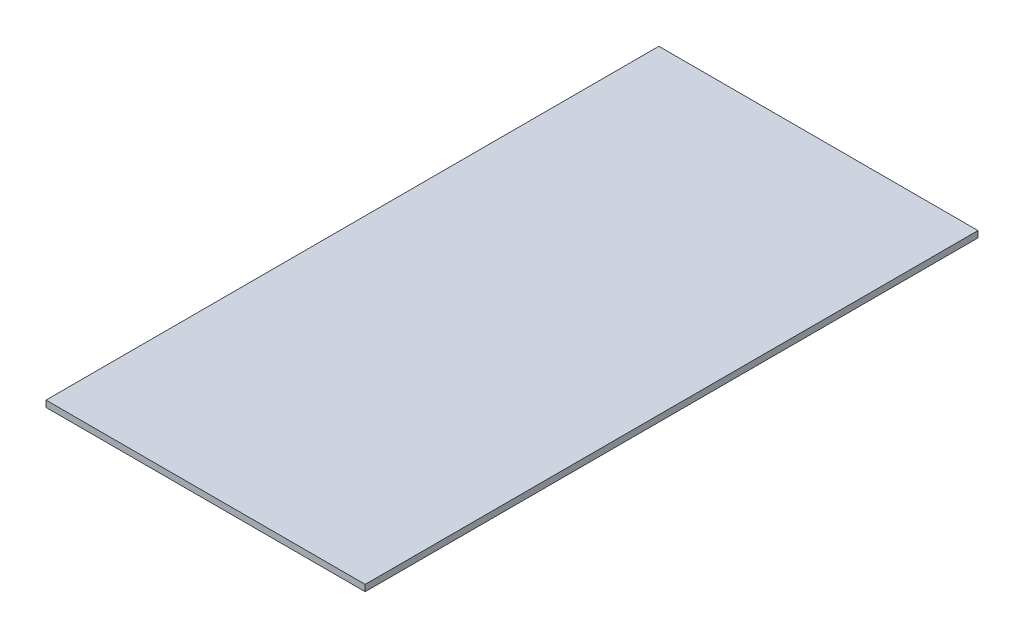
from build123d import *

# Parameters (mm, degrees)
SKETCH1_W           = 635
SKETCH1_H           = 1219.2
BOSS_EXTRUDE1_DEPTH = 6.35


with BuildPart() as part:
    # Sketch1 → Boss-Extrude1 (new, symmetric)
    with BuildSketch(Plane(origin=(0, 0, 0), x_dir=(1, 0, 0), z_dir=(0, 1, 0))):
        Rectangle(SKETCH1_W, SKETCH1_H)
    extrude(amount=BOSS_EXTRUDE1_DEPTH, both=True)


solid = part.part
